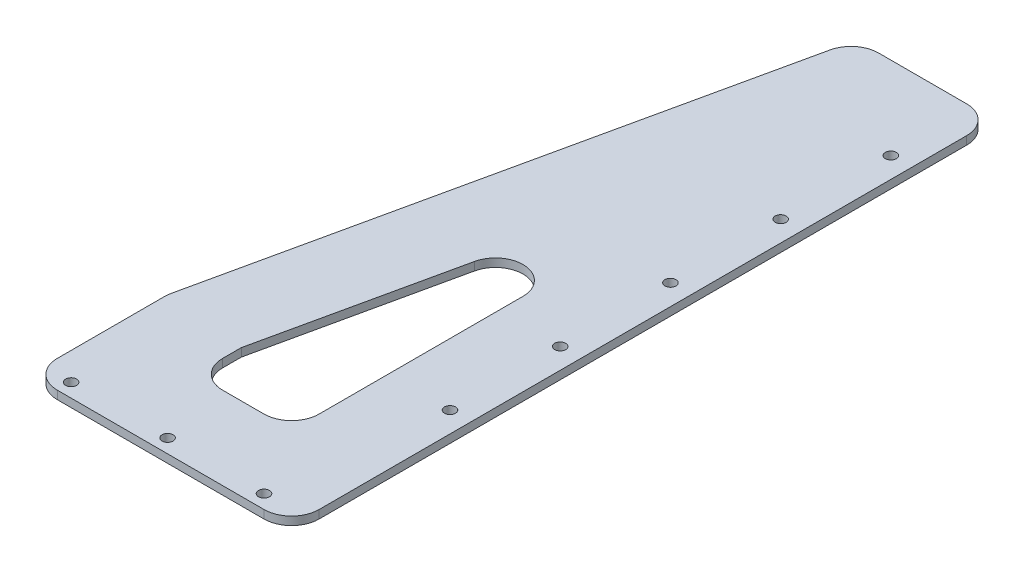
from build123d import *

# Parameters (mm, degrees)
EXTRUDE_1_DEPTH     = 3
CUT_EXTRUDE_1_REACH = 274.138
SKETCH_2_R          = 2
FILLET_1_R          = 10


with BuildPart() as part:
    # Sketch 1 → Extrude 1 (new body)
    with BuildSketch(Plane(origin=(0, 0, 0), x_dir=(1, 0, 0), z_dir=(0, 1, 0))):
        Polygon((0, 0), (95, 0), (95, 255), (45, 255), (0, 50), align=None)
        Polygon((30, 30), (65, 30), (65, 91.492066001), (65, 206.190498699), (30, 46.746054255), align=None, mode=Mode.SUBTRACT)
    extrude(amount=EXTRUDE_1_DEPTH)

    # Sketch 2 → Cut-Extrude 1 (cut, up to next)
    with BuildSketch(Plane(origin=(0, 3, 0), x_dir=(1, 0, 0), z_dir=(0, 1, 0)), mode=Mode.PRIVATE) as cut_extrude_1_sk1:
        with Locations(Location((10, 5, 0), (0, 0, 270))):
            Circle(SKETCH_2_R)
    cut_extrude_1_tool1 = extrude(cut_extrude_1_sk1.sketch, amount=-CUT_EXTRUDE_1_REACH, mode=Mode.PRIVATE) & part.part
    # Sketch 2 → Cut-Extrude 1 (cut, up to next)
    with BuildSketch(Plane(origin=(0, 3, 0), x_dir=(1, 0, 0), z_dir=(0, 1, 0)), mode=Mode.PRIVATE) as cut_extrude_1_sk2:
        with Locations(Location((45, 5, 0), (0, 0, 270))):
            Circle(SKETCH_2_R)
    cut_extrude_1_tool2 = extrude(cut_extrude_1_sk2.sketch, amount=-CUT_EXTRUDE_1_REACH, mode=Mode.PRIVATE) & part.part
    # Sketch 2 → Cut-Extrude 1 (cut, up to next)
    with BuildSketch(Plane(origin=(0, 3, 0), x_dir=(1, 0, 0), z_dir=(0, 1, 0)), mode=Mode.PRIVATE) as cut_extrude_1_sk3:
        with Locations(Location((80, 5, 0), (0, 0, 270))):
            Circle(SKETCH_2_R)
    cut_extrude_1_tool3 = extrude(cut_extrude_1_sk3.sketch, amount=-CUT_EXTRUDE_1_REACH, mode=Mode.PRIVATE) & part.part
    # Sketch 2 → Cut-Extrude 1 (cut, up to next)
    with BuildSketch(Plane(origin=(0, 3, 0), x_dir=(1, 0, 0), z_dir=(0, 1, 0)), mode=Mode.PRIVATE) as cut_extrude_1_sk4:
        with Locations(Location((87.5, 225, 0), (0, 0, 270))):
            Circle(SKETCH_2_R)
    cut_extrude_1_tool4 = extrude(cut_extrude_1_sk4.sketch, amount=-CUT_EXTRUDE_1_REACH, mode=Mode.PRIVATE) & part.part
    # Sketch 2 → Cut-Extrude 1 (cut, up to next)
    with BuildSketch(Plane(origin=(0, 3, 0), x_dir=(1, 0, 0), z_dir=(0, 1, 0)), mode=Mode.PRIVATE) as cut_extrude_1_sk5:
        with Locations(Location((87.5, 185, 0), (0, 0, 270))):
            Circle(SKETCH_2_R)
    cut_extrude_1_tool5 = extrude(cut_extrude_1_sk5.sketch, amount=-CUT_EXTRUDE_1_REACH, mode=Mode.PRIVATE) & part.part
    # Sketch 2 → Cut-Extrude 1 (cut, up to next)
    with BuildSketch(Plane(origin=(0, 3, 0), x_dir=(1, 0, 0), z_dir=(0, 1, 0)), mode=Mode.PRIVATE) as cut_extrude_1_sk6:
        with Locations(Location((87.5, 145, 0), (0, 0, 270))):
            Circle(SKETCH_2_R)
    cut_extrude_1_tool6 = extrude(cut_extrude_1_sk6.sketch, amount=-CUT_EXTRUDE_1_REACH, mode=Mode.PRIVATE) & part.part
    # Sketch 2 → Cut-Extrude 1 (cut, up to next)
    with BuildSketch(Plane(origin=(0, 3, 0), x_dir=(1, 0, 0), z_dir=(0, 1, 0)), mode=Mode.PRIVATE) as cut_extrude_1_sk7:
        with Locations(Location((87.5, 105, 0), (0, 0, 270))):
            Circle(SKETCH_2_R)
    cut_extrude_1_tool7 = extrude(cut_extrude_1_sk7.sketch, amount=-CUT_EXTRUDE_1_REACH, mode=Mode.PRIVATE) & part.part
    # Sketch 2 → Cut-Extrude 1 (cut, up to next)
    with BuildSketch(Plane(origin=(0, 3, 0), x_dir=(1, 0, 0), z_dir=(0, 1, 0)), mode=Mode.PRIVATE) as cut_extrude_1_sk8:
        with Locations(Location((87.5, 65, 0), (0, 0, 270))):
            Circle(SKETCH_2_R)
    cut_extrude_1_tool8 = extrude(cut_extrude_1_sk8.sketch, amount=-CUT_EXTRUDE_1_REACH, mode=Mode.PRIVATE) & part.part
    add(cut_extrude_1_tool1.solids().sort_by_distance((10, 3, -5))[0], mode=Mode.SUBTRACT)
    add(cut_extrude_1_tool2.solids().sort_by_distance((45, 3, -5))[0], mode=Mode.SUBTRACT)
    add(cut_extrude_1_tool3.solids().sort_by_distance((80, 3, -5))[0], mode=Mode.SUBTRACT)
    add(cut_extrude_1_tool4.solids().sort_by_distance((87.5, 3, -225))[0], mode=Mode.SUBTRACT)
    add(cut_extrude_1_tool5.solids().sort_by_distance((87.5, 3, -185))[0], mode=Mode.SUBTRACT)
    add(cut_extrude_1_tool6.solids().sort_by_distance((87.5, 3, -145))[0], mode=Mode.SUBTRACT)
    add(cut_extrude_1_tool7.solids().sort_by_distance((87.5, 3, -105))[0], mode=Mode.SUBTRACT)
    add(cut_extrude_1_tool8.solids().sort_by_distance((87.5, 3, -65))[0], mode=Mode.SUBTRACT)

    # Fillet 1
    fillet_1_edges = [part.edges().sort_by_distance(p)[0] for p in [
        (30, 1.5, -30),
        (65, 1.5, -30),
        (65, 1.5, -206.190498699),
        (0, 1.5, -50),
        (45, 1.5, -255),
        (95, 1.5, -255),
        (95, 1.5, 0),
        (0, 1.5, 0),
    ]]
    fillet(fillet_1_edges, radius=FILLET_1_R)


solid = part.part
